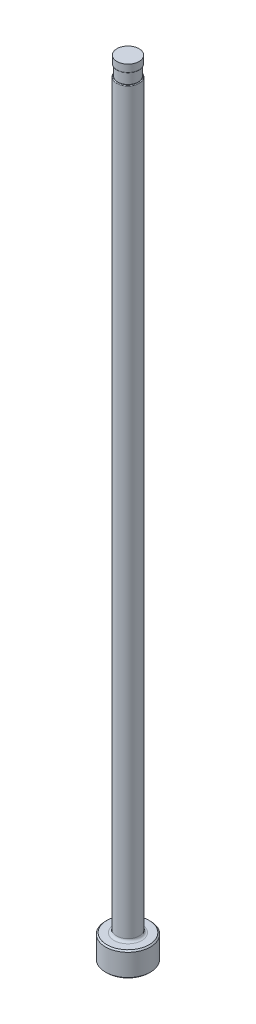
from build123d import *

# Parameters (mm, degrees)
CHAMFER1_SIZE     = 0.254
FILLET1_R         = 0.508
SKETCH2_W         = 0.2032
SKETCH2_H         = 2.032
D_SLOT_DEPTH      = 153.524461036
D_SLOT_DEPTH_BACK = 153.524461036
SKETCH5_W         = 0.0254
SKETCH5_H         = 1.524
FILLET2_R         = 0.127


with BuildPart() as part:
    # Sketch1 → Revolve1 (revolve)
    with BuildSketch(Plane.XY, mode=Mode.PRIVATE) as revolve1_sk:
        Polygon((0, 0), (-4.3561, 0), (-4.3561, 4.7498), (-2.18186, 4.7498), (-2.18186, 152.4), (0, 152.4), align=None)
    revolve(revolve1_sk.sketch.rotate(Axis((0, 259.958771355, 0), (0, -1, 0)), 270), axis=Axis((0, 259.958771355, 0), (0, -1, 0)))

    # Chamfer1
    chamfer1_edges = [part.edges().sort_by_distance(p)[0] for p in [
        (0, 4.7498, -4.3561),
        (0, 0, -4.3561),
    ]]
    chamfer(chamfer1_edges, length=CHAMFER1_SIZE)

    # Fillet1
    fillet1_edges = [part.edges().sort_by_distance(p)[0] for p in [
        (0, 4.7498, -2.18186),
    ]]
    fillet(fillet1_edges, radius=FILLET1_R)

    # Sketch2 → Vent Relief (revolve, cut)
    with BuildSketch(Plane.XY, mode=Mode.PRIVATE) as vent_relief_sk:
        with Locations((-2.08026, 149.86)):
            Rectangle(SKETCH2_W, SKETCH2_H)
    revolve(vent_relief_sk.sketch.rotate(Axis((0, 153.448281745, 0), (0, -1, 0)), 270), axis=Axis((0, 153.448281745, 0), (0, -1, 0)), mode=Mode.SUBTRACT)

    # Sketch3 → D-Slot (cut, two sides: drawn at the far end of the back side and taken through both)
    with BuildSketch(Plane.XY.offset(-D_SLOT_DEPTH_BACK)):
        with BuildLine():
            Line((-1.97866, 149.86), (-1.97866, 86.36))
            ThreePointArc((-1.97866, 86.36), (-2.029873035, 85.792038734), (-2.18186, 85.2424))
            Line((-2.18186, 85.2424), (-2.18186, 149.86))
            Line((-2.18186, 149.86), (-1.97866, 149.86))
        make_face()
    extrude(amount=D_SLOT_DEPTH + D_SLOT_DEPTH_BACK, mode=Mode.SUBTRACT)

    # Sketch5 → Vent Diameter (revolve, cut)
    with BuildSketch(Plane.XY, mode=Mode.PRIVATE) as vent_diameter_sk:
        with Locations((-2.16916, 151.638)):
            Rectangle(SKETCH5_W, SKETCH5_H)
    revolve(vent_diameter_sk.sketch.rotate(Axis((0, 152.687735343, 0), (0, -1, 0)), 90), axis=Axis((0, 152.687735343, 0), (0, -1, 0)), mode=Mode.SUBTRACT)

    # Fillet2
    fillet2_edges = [part.edges().sort_by_distance(p)[0] for p in [
        (1.839382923, 148.844, -1.173534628),
        (0, 150.876, 2.15646),
    ]]
    fillet(fillet2_edges, radius=FILLET2_R)


solid = part.part
